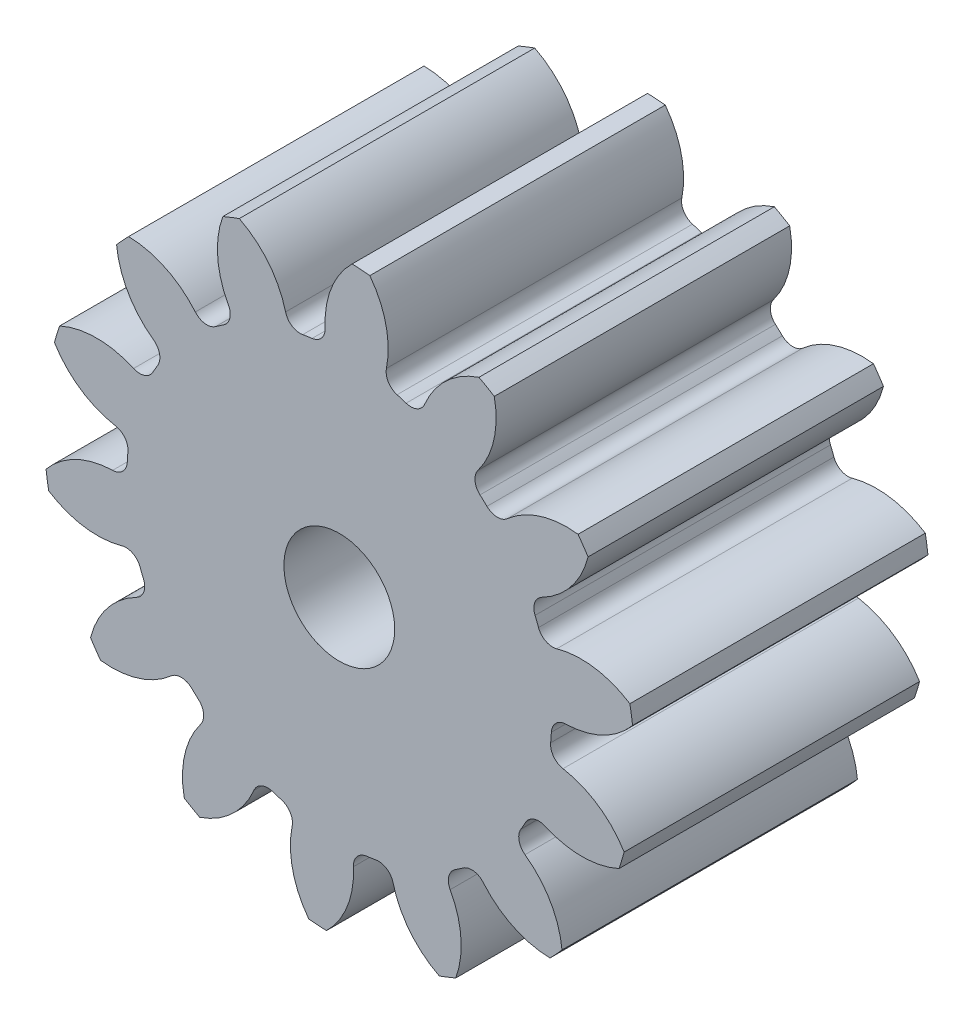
from build123d import *

# Parameters (mm, degrees)
SKETCH3_R         = 101.6
GEARBODY_DEPTH    = 101.6
TOOTHCUT_DEPTH    = 176.976362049
CIRPATTERN1_COUNT = 14
BOREDIA_R         = 19.05
BORE_DEPTH        = 12700


with BuildPart() as part:
    # Sketch3 → gearBody (new body)
    with BuildSketch(Plane.XY):
        Circle(SKETCH3_R)
    extrude(amount=GEARBODY_DEPTH)

    # Sketch2 → toothCut (cut, through all)
    with BuildSketch(Plane.XY):
        with BuildLine():
            ThreePointArc((72.689689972, -6.989964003), (72.827605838, -5.365673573), (72.92923061, -3.738709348))
            ThreePointArc((72.92923061, -3.738709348), (74.483990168, -0.301390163), (77.960393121, 1.163895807))
            ThreePointArc((77.960393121, 1.163895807), (91.138212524, 4.496792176), (101.6, 13.175163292))
            ThreePointArc((101.6, 13.175163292), (102.173760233, -7.527791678), (98.572028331, -27.923111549))
            ThreePointArc((98.572028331, -27.923111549), (89.495082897, -17.805197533), (76.948014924, -12.576984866))
            ThreePointArc((76.948014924, -12.576984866), (73.723897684, -10.618028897), (72.689689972, -6.989964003))
        make_face()
    toothcut = extrude(amount=TOOTHCUT_DEPTH, mode=Mode.SUBTRACT)

    # CirPattern1: toothCut ×14 about axis
    cirpattern1_axis = Axis((0, 0, 0), (0, 0, 1))
    for i in range(1, CIRPATTERN1_COUNT):
        add(toothcut.rotate(cirpattern1_axis, i * 360 / CIRPATTERN1_COUNT), mode=Mode.SUBTRACT)

    # boreDia → bore (cut, symmetric)
    with BuildSketch(Plane.XY):
        Circle(BOREDIA_R)
    extrude(amount=BORE_DEPTH, both=True, mode=Mode.SUBTRACT)


solid = part.part
